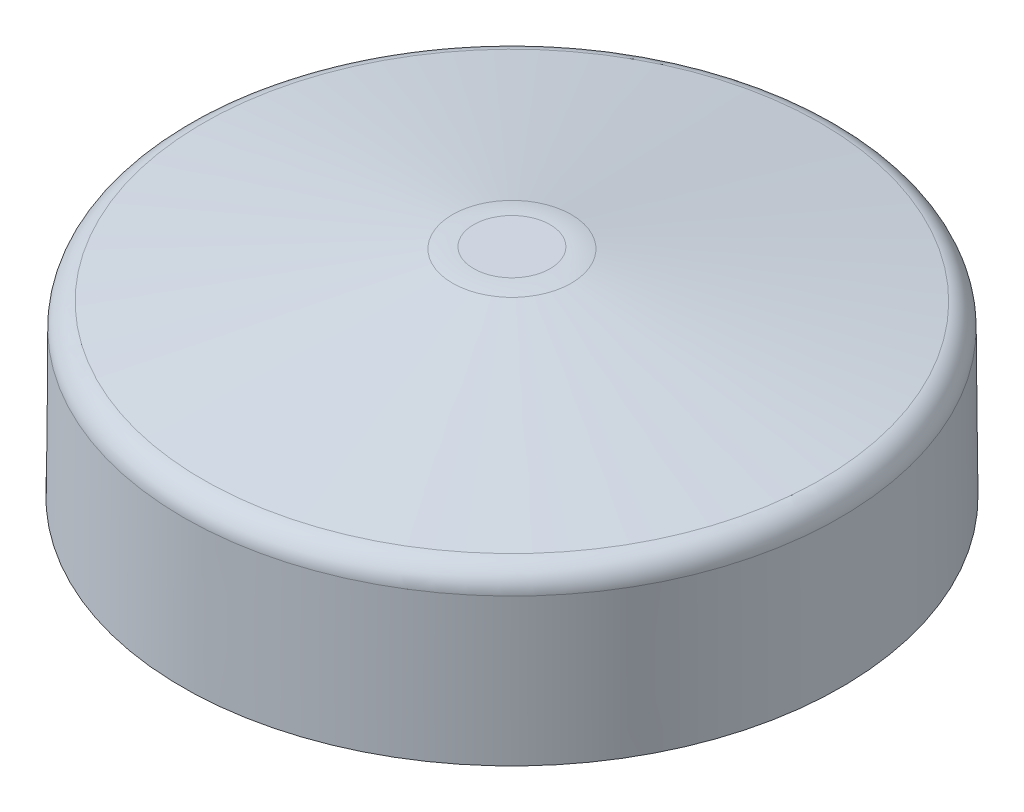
ISO-10303-21;
HEADER;
FILE_DESCRIPTION(('STEP AP214'),'2;1');
FILE_NAME('part.step','',(''),(''),'','','');
FILE_SCHEMA(('AUTOMOTIVE_DESIGN { 1 0 10303 214 1 1 1 1 }'));
ENDSEC;
DATA;
#1=APPLICATION_CONTEXT('core data for automotive mechanical design processes');
#2=APPLICATION_PROTOCOL_DEFINITION('international standard','automotive_design',2000,#1);
#3=PRODUCT_CONTEXT('',#1,'mechanical');
#4=PRODUCT('Part','Part','',(#3));
#5=PRODUCT_RELATED_PRODUCT_CATEGORY('part','',(#4));
#6=PRODUCT_DEFINITION_FORMATION('','',#4);
#7=PRODUCT_DEFINITION_CONTEXT('part definition',#1,'design');
#8=PRODUCT_DEFINITION('design','',#6,#7);
#9=PRODUCT_DEFINITION_SHAPE('','',#8);
#10=(LENGTH_UNIT() NAMED_UNIT(*) SI_UNIT(.MILLI.,.METRE.));
#11=(NAMED_UNIT(*) PLANE_ANGLE_UNIT() SI_UNIT($,.RADIAN.));
#12=(NAMED_UNIT(*) SI_UNIT($,.STERADIAN.) SOLID_ANGLE_UNIT());
#13=UNCERTAINTY_MEASURE_WITH_UNIT(LENGTH_MEASURE(1.E-05),#10,'distance_accuracy_value','');
#14=(GEOMETRIC_REPRESENTATION_CONTEXT(3) GLOBAL_UNCERTAINTY_ASSIGNED_CONTEXT((#13)) GLOBAL_UNIT_ASSIGNED_CONTEXT((#10,
#11,#12)) REPRESENTATION_CONTEXT('',''));
#15=CARTESIAN_POINT('',(0.,0.,0.));
#16=DIRECTION('',(0.,0.,1.));
#17=DIRECTION('',(1.,0.,0.));
#18=AXIS2_PLACEMENT_3D('',#15,#16,#17);
#19=CARTESIAN_POINT('',(25.,0.,0.));
#20=DIRECTION('',(0.,-1.,0.));
#21=DIRECTION('',(0.,0.,-1.));
#22=AXIS2_PLACEMENT_3D('',#19,#20,#21);
#23=PLANE('',#22);
#24=CARTESIAN_POINT('',(25.,0.,0.));
#25=DIRECTION('',(0.,-1.,0.));
#26=DIRECTION('',(0.,0.,-1.));
#27=AXIS2_PLACEMENT_3D('',#24,#25,#26);
#28=CIRCLE('',#27,2.25);
#29=CARTESIAN_POINT('',(24.89875,0.,-2.24772072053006));
#30=VERTEX_POINT('',#29);
#31=CARTESIAN_POINT('',(24.89875,0.,2.24772072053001));
#32=VERTEX_POINT('',#31);
#33=EDGE_CURVE('E64',#30,#32,#28,.T.);
#34=ORIENTED_EDGE('',*,*,#33,.F.);
#35=CARTESIAN_POINT('',(0.,0.,0.));
#36=DIRECTION('',(0.,-1.,0.));
#37=DIRECTION('',(0.,0.,-1.));
#38=AXIS2_PLACEMENT_3D('',#35,#36,#37);
#39=CIRCLE('',#38,25.);
#40=EDGE_CURVE('E75',#32,#30,#39,.T.);
#41=ORIENTED_EDGE('',*,*,#40,.F.);
#42=EDGE_LOOP('',(#34,#41));
#43=FACE_BOUND('',#42,.T.);
#44=CARTESIAN_POINT('',(0.,0.,0.));
#45=DIRECTION('',(0.,-1.,0.));
#46=DIRECTION('',(0.,0.,-1.));
#47=AXIS2_PLACEMENT_3D('',#44,#45,#46);
#48=CIRCLE('',#47,27.8301077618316);
#49=CARTESIAN_POINT('',(0.,0.,-27.8301077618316));
#50=VERTEX_POINT('',#49);
#51=EDGE_CURVE('E71',#50,#50,#48,.T.);
#52=ORIENTED_EDGE('',*,*,#51,.T.);
#53=EDGE_LOOP('',(#52));
#54=FACE_BOUND('',#53,.T.);
#55=ADVANCED_FACE('F30',(#43,#54),#23,.T.);
#56=CARTESIAN_POINT('',(0.,11.6356765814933,0.));
#57=DIRECTION('',(0.,-1.,0.));
#58=DIRECTION('',(0.,0.,-1.));
#59=AXIS2_PLACEMENT_3D('',#56,#57,#58);
#60=CONICAL_SURFACE('',#59,24.8984569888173,0.00872664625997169);
#61=CARTESIAN_POINT('',(24.7481466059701,18.1155849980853,-2.1562970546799));
#62=CARTESIAN_POINT('',(24.7731846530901,15.0963250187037,-2.1724672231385));
#63=CARTESIAN_POINT('',(24.7982539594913,12.0770629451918,-2.18817094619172));
#64=CARTESIAN_POINT('',(24.8484550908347,6.03853461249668,-2.21864550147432));
#65=CARTESIAN_POINT('',(24.8735869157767,3.01926835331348,-2.23341633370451));
#66=CARTESIAN_POINT('',(24.89875,0.,-2.24772072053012));
#67=B_SPLINE_CURVE_WITH_KNOTS('',3,(#61,#62,#63,#64,#65,#66),.UNSPECIFIED.,.F.,.F.,(4,2,4),(0.,
9.05822095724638,18.1164419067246),.UNSPECIFIED.);
#68=CARTESIAN_POINT('',(24.8712415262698,3.30218165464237,-2.23188043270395));
#69=VERTEX_POINT('',#68);
#70=EDGE_CURVE('E67',#69,#30,#67,.T.);
#71=ORIENTED_EDGE('',*,*,#70,.F.);
#72=CARTESIAN_POINT('',(24.8712415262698,3.30218165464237,-2.23188043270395));
#73=CARTESIAN_POINT('',(24.8710039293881,3.33029760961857,-2.23176781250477));
#74=CARTESIAN_POINT('',(24.8709853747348,3.35839653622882,-2.22924584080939));
#75=CARTESIAN_POINT('',(24.8713671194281,3.41375829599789,-2.21956200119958));
#76=CARTESIAN_POINT('',(24.8717670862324,3.44102177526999,-2.21240381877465));
#77=CARTESIAN_POINT('',(24.8729666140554,3.49397039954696,-2.19362113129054));
#78=CARTESIAN_POINT('',(24.8737663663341,3.51965478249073,-2.18199448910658));
#79=CARTESIAN_POINT('',(24.8757234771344,3.56869896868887,-2.15461412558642));
#80=CARTESIAN_POINT('',(24.8768807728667,3.59205917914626,-2.1388611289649));
#81=CARTESIAN_POINT('',(24.8794983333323,3.63580059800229,-2.10366868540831));
#82=CARTESIAN_POINT('',(24.8809586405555,3.65618138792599,-2.08422872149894));
#83=CARTESIAN_POINT('',(24.8841169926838,3.69338648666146,-2.04220924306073));
#84=CARTESIAN_POINT('',(24.8858150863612,3.71021006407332,-2.01962908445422));
#85=CARTESIAN_POINT('',(24.8893783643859,3.73982643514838,-1.97196152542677));
#86=CARTESIAN_POINT('',(24.8912436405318,3.75261699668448,-1.94687274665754));
#87=CARTESIAN_POINT('',(24.895067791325,3.77378688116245,-1.89491264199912));
#88=CARTESIAN_POINT('',(24.8970266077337,3.78216891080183,-1.86804242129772));
#89=CARTESIAN_POINT('',(24.9002682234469,3.79214214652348,-1.82301287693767));
#90=CARTESIAN_POINT('',(24.9015445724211,3.7950872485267,-1.80514136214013));
#91=CARTESIAN_POINT('',(24.9040889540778,3.799015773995,-1.76921001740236));
#92=CARTESIAN_POINT('',(24.9053569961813,3.80000205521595,-1.75115050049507));
#93=CARTESIAN_POINT('',(24.9066140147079,3.8,-1.73308198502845));
#94=B_SPLINE_CURVE_WITH_KNOTS('',3,(#72,#73,#74,#75,#76,#77,#78,#79,#80,#81,#82,#83,#84,#85,#86,
#87,#88,#89,#90,#91,#92,#93),.UNSPECIFIED.,.F.,.F.,(4,2,2,2,2,2,2,2,2,2,4),(0.,
0.0842393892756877,0.168411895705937,0.252624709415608,0.336822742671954,0.421032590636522,
0.505259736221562,0.589533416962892,0.673755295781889,0.728128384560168,0.782422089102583),.UNSPECIFIED.);
#95=CARTESIAN_POINT('',(24.9066140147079,3.8,-1.73308198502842));
#96=VERTEX_POINT('',#95);
#97=EDGE_CURVE('E187',#69,#96,#94,.T.);
#98=ORIENTED_EDGE('',*,*,#97,.T.);
#99=CARTESIAN_POINT('',(0.,3.8,0.));
#100=DIRECTION('',(0.,1.,0.));
#101=DIRECTION('',(0.,0.,1.));
#102=AXIS2_PLACEMENT_3D('',#99,#100,#101);
#103=CIRCLE('',#102,24.9668379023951);
#104=CARTESIAN_POINT('',(24.9066140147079,3.8,1.73308198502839));
#105=VERTEX_POINT('',#104);
#106=EDGE_CURVE('E76',#105,#96,#103,.T.);
#107=ORIENTED_EDGE('',*,*,#106,.F.);
#108=CARTESIAN_POINT('',(24.9066140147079,3.8,1.73308198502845));
#109=CARTESIAN_POINT('',(24.9046625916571,3.8000238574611,1.76114985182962));
#110=CARTESIAN_POINT('',(24.9026816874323,3.79762716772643,1.78920847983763));
#111=CARTESIAN_POINT('',(24.8987286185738,3.78816903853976,1.84450724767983));
#112=CARTESIAN_POINT('',(24.8967564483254,3.78111124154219,1.87174800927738));
#113=CARTESIAN_POINT('',(24.8928843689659,3.76250227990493,1.92466995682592));
#114=CARTESIAN_POINT('',(24.8909844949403,3.75094896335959,1.95035038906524));
#115=CARTESIAN_POINT('',(24.8873306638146,3.72368674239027,1.99940646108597));
#116=CARTESIAN_POINT('',(24.8855766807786,3.70797857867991,2.02278251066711));
#117=CARTESIAN_POINT('',(24.8822862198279,3.6728498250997,2.06657193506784));
#118=CARTESIAN_POINT('',(24.8807497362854,3.65342933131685,2.08698538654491));
#119=CARTESIAN_POINT('',(24.8779616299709,3.61142180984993,2.12427607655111));
#120=CARTESIAN_POINT('',(24.8767100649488,3.58883414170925,2.14115259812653));
#121=CARTESIAN_POINT('',(24.8745509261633,3.54114079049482,2.17088480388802));
#122=CARTESIAN_POINT('',(24.8736433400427,3.51603519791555,2.18374063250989));
#123=CARTESIAN_POINT('',(24.8722179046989,3.46402180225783,2.20506285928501));
#124=CARTESIAN_POINT('',(24.8716998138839,3.43711512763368,2.21353197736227));
#125=CARTESIAN_POINT('',(24.8711911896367,3.39205809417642,2.22365432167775));
#126=CARTESIAN_POINT('',(24.8710784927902,3.37420143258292,2.22666073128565));
#127=CARTESIAN_POINT('',(24.8710283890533,3.33829425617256,2.23072956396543));
#128=CARTESIAN_POINT('',(24.8710907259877,3.32024406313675,2.23179482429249));
#129=CARTESIAN_POINT('',(24.8712415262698,3.30218165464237,2.23188043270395));
#130=B_SPLINE_CURVE_WITH_KNOTS('',3,(#108,#109,#110,#111,#112,#113,#114,#115,#116,#117,#118,
#119,#120,#121,#122,#123,#124,#125,#126,#127,#128,#129),.UNSPECIFIED.,.F.,.F.,(4,2,2,2,2,2,2,2,
2,2,4),(0.,0.0842946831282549,0.168523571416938,0.252792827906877,0.337047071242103,
0.421299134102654,0.505568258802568,0.589834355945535,0.674048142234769,0.728274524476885,
0.782421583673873),.UNSPECIFIED.);
#131=CARTESIAN_POINT('',(24.8712415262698,3.30218165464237,2.23188043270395));
#132=VERTEX_POINT('',#131);
#133=EDGE_CURVE('E45',#105,#132,#130,.T.);
#134=ORIENTED_EDGE('',*,*,#133,.T.);
#135=CARTESIAN_POINT('',(24.89875,0.,2.24772072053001));
#136=CARTESIAN_POINT('',(24.8934716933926,0.633333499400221,2.24471683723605));
#137=CARTESIAN_POINT('',(24.8881947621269,1.26666691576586,2.24169328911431));
#138=CARTESIAN_POINT('',(24.8776436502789,2.53333358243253,2.23560686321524));
#139=CARTESIAN_POINT('',(24.8723694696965,3.16666683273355,2.2325439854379));
#140=CARTESIAN_POINT('',(24.8670966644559,3.8,2.22946144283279));
#141=B_SPLINE_CURVE_WITH_KNOTS('',3,(#135,#136,#137,#138,#139,#140),.UNSPECIFIED.,.F.,.F.,(4,2,
4),(0.,1.90008784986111,3.80017569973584),.UNSPECIFIED.);
#142=EDGE_CURVE('E66',#32,#132,#141,.T.);
#143=ORIENTED_EDGE('',*,*,#142,.F.);
#144=ORIENTED_EDGE('',*,*,#40,.T.);
#145=EDGE_LOOP('',(#71,#98,#107,#134,#143,#144));
#146=FACE_BOUND('',#145,.T.);
#147=CARTESIAN_POINT('',(0.,10.8089531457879,0.));
#148=DIRECTION('',(0.,-1.,0.));
#149=DIRECTION('',(0.,0.,-1.));
#150=AXIS2_PLACEMENT_3D('',#147,#148,#149);
#151=CIRCLE('',#150,24.9056716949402);
#152=CARTESIAN_POINT('',(0.,10.8089531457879,-24.9056716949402));
#153=VERTEX_POINT('',#152);
#154=EDGE_CURVE('E101',#153,#153,#151,.F.);
#155=ORIENTED_EDGE('',*,*,#154,.T.);
#156=EDGE_LOOP('',(#155));
#157=FACE_BOUND('',#156,.T.);
#158=ADVANCED_FACE('F73',(#146,#157),#60,.F.);
#159=CARTESIAN_POINT('',(0.,15.4233261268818,0.));
#160=DIRECTION('',(0.,-1.,0.));
#161=DIRECTION('',(0.,0.,-1.));
#162=AXIS2_PLACEMENT_3D('',#159,#160,#161);
#163=CONICAL_SURFACE('',#162,4.12887400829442,1.39041334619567);
#164=CARTESIAN_POINT('',(0.,15.2138790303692,0.));
#165=DIRECTION('',(0.,-1.,0.));
#166=DIRECTION('',(0.,0.,-1.));
#167=AXIS2_PLACEMENT_3D('',#164,#165,#166);
#168=CIRCLE('',#167,5.27737753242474);
#169=CARTESIAN_POINT('',(0.,15.2138790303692,-5.27737753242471));
#170=VERTEX_POINT('',#169);
#171=EDGE_CURVE('E98',#170,#170,#168,.F.);
#172=CARTESIAN_POINT('',(0.,11.7840016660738,0.));
#173=DIRECTION('',(0.,-1.,0.));
#174=DIRECTION('',(0.,0.,-1.));
#175=AXIS2_PLACEMENT_3D('',#172,#173,#174);
#176=CIRCLE('',#175,24.0851161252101);
#177=CARTESIAN_POINT('',(0.,11.7840016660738,-24.0851161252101));
#178=VERTEX_POINT('',#177);
#179=EDGE_CURVE('E95',#178,#178,#176,.T.);
#180=CARTESIAN_POINT('',(0.,15.2138790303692,-5.27737753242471));
#181=CARTESIAN_POINT('',(0.,15.1781511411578,-5.47329147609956));
#182=CARTESIAN_POINT('',(0.,15.1424232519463,-5.66920541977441));
#183=CARTESIAN_POINT('',(0.,15.0709674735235,-6.0610333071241));
#184=CARTESIAN_POINT('',(0.,15.0352395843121,-6.25694725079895));
#185=CARTESIAN_POINT('',(0.,14.9637838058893,-6.64877513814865));
#186=CARTESIAN_POINT('',(0.,14.9280559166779,-6.84468908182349));
#187=CARTESIAN_POINT('',(0.,14.8566001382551,-7.23651696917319));
#188=CARTESIAN_POINT('',(0.,14.8208722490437,-7.43243091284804));
#189=CARTESIAN_POINT('',(0.,14.7494164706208,-7.82425880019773));
#190=CARTESIAN_POINT('',(0.,14.7136885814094,-8.02017274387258));
#191=CARTESIAN_POINT('',(0.,14.6422328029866,-8.41200063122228));
#192=CARTESIAN_POINT('',(0.,14.6065049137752,-8.60791457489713));
#193=CARTESIAN_POINT('',(0.,14.5350491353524,-8.99974246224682));
#194=CARTESIAN_POINT('',(0.,14.499321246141,-9.19565640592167));
#195=CARTESIAN_POINT('',(0.,14.4278654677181,-9.58748429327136));
#196=CARTESIAN_POINT('',(0.,14.3921375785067,-9.78339823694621));
#197=CARTESIAN_POINT('',(0.,14.3206818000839,-10.1752261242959));
#198=CARTESIAN_POINT('',(0.,14.2849539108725,-10.3711400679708));
#199=CARTESIAN_POINT('',(0.,14.2134981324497,-10.7629679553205));
#200=CARTESIAN_POINT('',(0.,14.1777702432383,-10.9588818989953));
#201=CARTESIAN_POINT('',(0.,14.1063144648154,-11.350709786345));
#202=CARTESIAN_POINT('',(0.,14.070586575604,-11.5466237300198));
#203=CARTESIAN_POINT('',(0.,13.9991307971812,-11.9384516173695));
#204=CARTESIAN_POINT('',(0.,13.9634029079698,-12.1343655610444));
#205=CARTESIAN_POINT('',(0.,13.891947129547,-12.5261934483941));
#206=CARTESIAN_POINT('',(0.,13.8562192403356,-12.7221073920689));
#207=CARTESIAN_POINT('',(0.,13.7847634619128,-13.1139352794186));
#208=CARTESIAN_POINT('',(0.,13.7490355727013,-13.3098492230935));
#209=CARTESIAN_POINT('',(0.,13.6775797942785,-13.7016771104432));
#210=CARTESIAN_POINT('',(0.,13.6418519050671,-13.897591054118));
#211=CARTESIAN_POINT('',(0.,13.5703961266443,-14.2894189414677));
#212=CARTESIAN_POINT('',(0.,13.5346682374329,-14.4853328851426));
#213=CARTESIAN_POINT('',(0.,13.4632124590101,-14.8771607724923));
#214=CARTESIAN_POINT('',(0.,13.4274845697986,-15.0730747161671));
#215=CARTESIAN_POINT('',(0.,13.3560287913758,-15.4649026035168));
#216=CARTESIAN_POINT('',(0.,13.3203009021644,-15.6608165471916));
#217=CARTESIAN_POINT('',(0.,13.2488451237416,-16.0526444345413));
#218=CARTESIAN_POINT('',(0.,13.2131172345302,-16.2485583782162));
#219=CARTESIAN_POINT('',(0.,13.1416614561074,-16.6403862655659));
#220=CARTESIAN_POINT('',(0.,13.105933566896,-16.8363002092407));
#221=CARTESIAN_POINT('',(0.,13.0344777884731,-17.2281280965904));
#222=CARTESIAN_POINT('',(0.,12.9987498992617,-17.4240420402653));
#223=CARTESIAN_POINT('',(0.,12.9272941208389,-17.815869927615));
#224=CARTESIAN_POINT('',(0.,12.8915662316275,-18.0117838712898));
#225=CARTESIAN_POINT('',(0.,12.8201104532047,-18.4036117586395));
#226=CARTESIAN_POINT('',(0.,12.7843825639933,-18.5995257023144));
#227=CARTESIAN_POINT('',(0.,12.7129267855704,-18.9913535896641));
#228=CARTESIAN_POINT('',(0.,12.677198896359,-19.1872675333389));
#229=CARTESIAN_POINT('',(0.,12.6057431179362,-19.5790954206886));
#230=CARTESIAN_POINT('',(0.,12.5700152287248,-19.7750093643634));
#231=CARTESIAN_POINT('',(0.,12.498559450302,-20.1668372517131));
#232=CARTESIAN_POINT('',(0.,12.4628315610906,-20.362751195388));
#233=CARTESIAN_POINT('',(0.,12.3913757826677,-20.7545790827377));
#234=CARTESIAN_POINT('',(0.,12.3556478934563,-20.9504930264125));
#235=CARTESIAN_POINT('',(0.,12.2841921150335,-21.3423209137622));
#236=CARTESIAN_POINT('',(0.,12.2484642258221,-21.5382348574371));
#237=CARTESIAN_POINT('',(0.,12.1770084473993,-21.9300627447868));
#238=CARTESIAN_POINT('',(0.,12.1412805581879,-22.1259766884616));
#239=CARTESIAN_POINT('',(0.,12.0698247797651,-22.5178045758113));
#240=CARTESIAN_POINT('',(0.,12.0340968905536,-22.7137185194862));
#241=CARTESIAN_POINT('',(0.,11.9626411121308,-23.1055464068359));
#242=CARTESIAN_POINT('',(0.,11.9269132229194,-23.3014603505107));
#243=CARTESIAN_POINT('',(0.,11.8554574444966,-23.6932882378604));
#244=CARTESIAN_POINT('',(0.,11.8197295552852,-23.8892021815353));
#245=CARTESIAN_POINT('',(0.,11.7840016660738,-24.0851161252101));
#246=B_SPLINE_CURVE_WITH_KNOTS('',3,(#180,#181,#182,#183,#184,#185,#186,#187,#188,#189,#190,
#191,#192,#193,#194,#195,#196,#197,#198,#199,#200,#201,#202,#203,#204,#205,#206,#207,#208,#209,
#210,#211,#212,#213,#214,#215,#216,#217,#218,#219,#220,#221,#222,#223,#224,#225,#226,#227,#228,
#229,#230,#231,#232,#233,#234,#235,#236,#237,#238,#239,#240,#241,#242,#243,#244,#245),
.UNSPECIFIED.,.F.,.F.,(4,2,2,2,2,2,2,2,2,2,2,2,2,2,2,2,2,2,2,2,2,2,2,2,2,2,2,2,2,2,2,2,4),(0.,
0.597435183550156,1.19487036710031,1.79230555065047,2.38974073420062,2.98717591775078,
3.58461110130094,4.18204628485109,4.77948146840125,5.3769166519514,5.97435183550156,
6.57178701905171,7.16922220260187,7.76665738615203,8.36409256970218,8.96152775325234,
9.55896293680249,10.1563981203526,10.7538333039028,11.351268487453,11.9487036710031,
12.5461388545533,13.1435740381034,13.7410092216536,14.3384444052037,14.9358795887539,
15.5333147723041,16.1307499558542,16.7281851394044,17.3256203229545,17.9230555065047,
18.5204906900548,19.117925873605),.UNSPECIFIED.);
#247=EDGE_CURVE('BSEAM127',#170,#178,#246,.T.);
#248=ORIENTED_EDGE('',*,*,#171,.T.);
#249=ORIENTED_EDGE('',*,*,#179,.T.);
#250=ORIENTED_EDGE('',*,*,#247,.T.);
#251=ORIENTED_EDGE('',*,*,#247,.F.);
#252=EDGE_LOOP('',(#248,#250,#249,#251));
#253=FACE_BOUND('',#252,.T.);
#254=ADVANCED_FACE('F127',(#253),#163,.F.);
#255=CARTESIAN_POINT('',(0.,0.,0.));
#256=DIRECTION('',(0.,1.,0.));
#257=DIRECTION('',(0.,0.,1.));
#258=AXIS2_PLACEMENT_3D('',#255,#256,#257);
#259=CONICAL_SURFACE('',#258,3.725,0.0261799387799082);
#260=CARTESIAN_POINT('',(0.,14.2562809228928,0.));
#261=DIRECTION('',(0.,1.,0.));
#262=DIRECTION('',(0.,0.,1.));
#263=AXIS2_PLACEMENT_3D('',#260,#261,#262);
#264=CIRCLE('',#263,4.09831385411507);
#265=CARTESIAN_POINT('',(0.,14.2562809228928,4.09831385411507));
#266=VERTEX_POINT('',#265);
#267=EDGE_CURVE('E92',#266,#266,#264,.F.);
#268=ORIENTED_EDGE('',*,*,#267,.T.);
#269=EDGE_LOOP('',(#268));
#270=FACE_BOUND('',#269,.T.);
#271=CARTESIAN_POINT('',(0.,0.,0.));
#272=DIRECTION('',(0.,-1.,0.));
#273=DIRECTION('',(0.,0.,-1.));
#274=AXIS2_PLACEMENT_3D('',#271,#272,#273);
#275=CIRCLE('',#274,3.725);
#276=CARTESIAN_POINT('',(0.,0.,-3.725));
#277=VERTEX_POINT('',#276);
#278=EDGE_CURVE('E80',#277,#277,#275,.T.);
#279=ORIENTED_EDGE('',*,*,#278,.F.);
#280=EDGE_LOOP('',(#279));
#281=FACE_BOUND('',#280,.T.);
#282=ADVANCED_FACE('F131',(#270,#281),#259,.T.);
#283=CARTESIAN_POINT('',(3.725,0.,0.));
#284=DIRECTION('',(0.,-1.,0.));
#285=DIRECTION('',(0.,0.,-1.));
#286=AXIS2_PLACEMENT_3D('',#283,#284,#285);
#287=PLANE('',#286);
#288=ORIENTED_EDGE('',*,*,#278,.T.);
#289=EDGE_LOOP('',(#288));
#290=FACE_BOUND('',#289,.T.);
#291=CARTESIAN_POINT('',(0.,0.,0.));
#292=DIRECTION('',(0.,-1.,0.));
#293=DIRECTION('',(0.,0.,-1.));
#294=AXIS2_PLACEMENT_3D('',#291,#292,#293);
#295=CIRCLE('',#294,1.725);
#296=CARTESIAN_POINT('',(0.,0.,-1.725));
#297=VERTEX_POINT('',#296);
#298=EDGE_CURVE('E86',#297,#297,#295,.T.);
#299=ORIENTED_EDGE('',*,*,#298,.F.);
#300=EDGE_LOOP('',(#299));
#301=FACE_BOUND('',#300,.T.);
#302=ADVANCED_FACE('F136',(#290,#301),#287,.T.);
#303=CARTESIAN_POINT('',(0.,0.,0.));
#304=DIRECTION('',(0.,-1.,0.));
#305=DIRECTION('',(0.,0.,-1.));
#306=AXIS2_PLACEMENT_3D('',#303,#304,#305);
#307=CONICAL_SURFACE('',#306,1.725,0.00436332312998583);
#308=ORIENTED_EDGE('',*,*,#298,.T.);
#309=EDGE_LOOP('',(#308));
#310=FACE_BOUND('',#309,.T.);
#311=CARTESIAN_POINT('',(0.,15.3,0.));
#312=DIRECTION('',(0.,-1.,0.));
#313=DIRECTION('',(0.,0.,-1.));
#314=AXIS2_PLACEMENT_3D('',#311,#312,#313);
#315=CIRCLE('',#314,1.65824073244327);
#316=CARTESIAN_POINT('',(0.,15.3,-1.65824073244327));
#317=VERTEX_POINT('',#316);
#318=EDGE_CURVE('E192',#317,#317,#315,.T.);
#319=ORIENTED_EDGE('',*,*,#318,.F.);
#320=EDGE_LOOP('',(#319));
#321=FACE_BOUND('',#320,.T.);
#322=ADVANCED_FACE('F32',(#310,#321),#307,.F.);
#323=CARTESIAN_POINT('',(1.725,15.3,0.));
#324=DIRECTION('',(0.,-1.,0.));
#325=DIRECTION('',(0.,0.,-1.));
#326=AXIS2_PLACEMENT_3D('',#323,#324,#325);
#327=PLANE('',#326);
#328=ORIENTED_EDGE('',*,*,#318,.T.);
#329=EDGE_LOOP('',(#328));
#330=FACE_BOUND('',#329,.T.);
#331=ADVANCED_FACE('F144',(#330),#327,.T.);
#332=CARTESIAN_POINT('',(4.12887400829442,18.3,0.));
#333=DIRECTION('',(0.,1.,0.));
#334=DIRECTION('',(0.,0.,1.));
#335=AXIS2_PLACEMENT_3D('',#332,#333,#334);
#336=PLANE('',#335);
#337=CARTESIAN_POINT('',(0.,18.3,0.));
#338=DIRECTION('',(0.,1.,0.));
#339=DIRECTION('',(0.,0.,1.));
#340=AXIS2_PLACEMENT_3D('',#337,#338,#339);
#341=CIRCLE('',#340,3.22450557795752);
#342=CARTESIAN_POINT('',(0.,18.3,3.22450557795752));
#343=VERTEX_POINT('',#342);
#344=EDGE_CURVE('E11',#343,#343,#341,.T.);
#345=ORIENTED_EDGE('',*,*,#344,.T.);
#346=EDGE_LOOP('',(#345));
#347=FACE_BOUND('',#346,.T.);
#348=ADVANCED_FACE('F147',(#347),#336,.T.);
#349=CARTESIAN_POINT('',(0.,14.,0.));
#350=DIRECTION('',(0.,-1.,0.));
#351=DIRECTION('',(0.,0.,-1.));
#352=AXIS2_PLACEMENT_3D('',#349,#350,#351);
#353=CONICAL_SURFACE('',#352,27.707931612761,1.39041334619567);
#354=CARTESIAN_POINT('',(0.,18.1377505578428,0.));
#355=DIRECTION('',(0.,1.,0.));
#356=DIRECTION('',(0.,0.,1.));
#357=AXIS2_PLACEMENT_3D('',#354,#355,#356);
#358=CIRCLE('',#357,5.01856911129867);
#359=CARTESIAN_POINT('',(0.,18.1377505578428,-5.01856911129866));
#360=VERTEX_POINT('',#359);
#361=EDGE_CURVE('E38',#360,#360,#358,.F.);
#362=CARTESIAN_POINT('',(0.,14.296650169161,0.));
#363=DIRECTION('',(0.,1.,0.));
#364=DIRECTION('',(0.,0.,1.));
#365=AXIS2_PLACEMENT_3D('',#362,#363,#364);
#366=CIRCLE('',#365,26.0812498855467);
#367=CARTESIAN_POINT('',(0.,14.296650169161,-26.0812498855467));
#368=VERTEX_POINT('',#367);
#369=EDGE_CURVE('E83',#368,#368,#366,.T.);
#370=CARTESIAN_POINT('',(0.,18.1377505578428,-5.01856911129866));
#371=CARTESIAN_POINT('',(0.,18.0977390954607,-5.23797203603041));
#372=CARTESIAN_POINT('',(0.,18.0577276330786,-5.45737496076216));
#373=CARTESIAN_POINT('',(0.,17.9777047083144,-5.89618081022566));
#374=CARTESIAN_POINT('',(0.,17.9376932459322,-6.11558373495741));
#375=CARTESIAN_POINT('',(0.,17.857670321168,-6.55438958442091));
#376=CARTESIAN_POINT('',(0.,17.8176588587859,-6.77379250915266));
#377=CARTESIAN_POINT('',(0.,17.7376359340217,-7.21259835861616));
#378=CARTESIAN_POINT('',(0.,17.6976244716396,-7.43200128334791));
#379=CARTESIAN_POINT('',(0.,17.6176015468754,-7.87080713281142));
#380=CARTESIAN_POINT('',(0.,17.5775900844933,-8.09021005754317));
#381=CARTESIAN_POINT('',(0.,17.4975671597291,-8.52901590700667));
#382=CARTESIAN_POINT('',(0.,17.457555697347,-8.74841883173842));
#383=CARTESIAN_POINT('',(0.,17.3775327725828,-9.18722468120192));
#384=CARTESIAN_POINT('',(0.,17.3375213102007,-9.40662760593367));
#385=CARTESIAN_POINT('',(0.,17.2574983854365,-9.84543345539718));
#386=CARTESIAN_POINT('',(0.,17.2174869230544,-10.0648363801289));
#387=CARTESIAN_POINT('',(0.,17.1374639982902,-10.5036422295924));
#388=CARTESIAN_POINT('',(0.,17.0974525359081,-10.7230451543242));
#389=CARTESIAN_POINT('',(0.,17.0174296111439,-11.1618510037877));
#390=CARTESIAN_POINT('',(0.,16.9774181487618,-11.3812539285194));
#391=CARTESIAN_POINT('',(0.,16.8973952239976,-11.8200597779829));
#392=CARTESIAN_POINT('',(0.,16.8573837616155,-12.0394627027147));
#393=CARTESIAN_POINT('',(0.,16.7773608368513,-12.4782685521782));
#394=CARTESIAN_POINT('',(0.,16.7373493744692,-12.6976714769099));
#395=CARTESIAN_POINT('',(0.,16.657326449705,-13.1364773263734));
#396=CARTESIAN_POINT('',(0.,16.6173149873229,-13.3558802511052));
#397=CARTESIAN_POINT('',(0.,16.5372920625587,-13.7946861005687));
#398=CARTESIAN_POINT('',(0.,16.4972806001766,-14.0140890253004));
#399=CARTESIAN_POINT('',(0.,16.4172576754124,-14.4528948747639));
#400=CARTESIAN_POINT('',(0.,16.3772462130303,-14.6722977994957));
#401=CARTESIAN_POINT('',(0.,16.2972232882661,-15.1111036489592));
#402=CARTESIAN_POINT('',(0.,16.257211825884,-15.330506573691));
#403=CARTESIAN_POINT('',(0.,16.1771889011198,-15.7693124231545));
#404=CARTESIAN_POINT('',(0.,16.1371774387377,-15.9887153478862));
#405=CARTESIAN_POINT('',(0.,16.0571545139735,-16.4275211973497));
#406=CARTESIAN_POINT('',(0.,16.0171430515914,-16.6469241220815));
#407=CARTESIAN_POINT('',(0.,15.9371201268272,-17.085729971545));
#408=CARTESIAN_POINT('',(0.,15.897108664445,-17.3051328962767));
#409=CARTESIAN_POINT('',(0.,15.8170857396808,-17.7439387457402));
#410=CARTESIAN_POINT('',(0.,15.7770742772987,-17.963341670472));
#411=CARTESIAN_POINT('',(0.,15.6970513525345,-18.4021475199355));
#412=CARTESIAN_POINT('',(0.,15.6570398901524,-18.6215504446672));
#413=CARTESIAN_POINT('',(0.,15.5770169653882,-19.0603562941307));
#414=CARTESIAN_POINT('',(0.,15.5370055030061,-19.2797592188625));
#415=CARTESIAN_POINT('',(0.,15.4569825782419,-19.718565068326));
#416=CARTESIAN_POINT('',(0.,15.4169711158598,-19.9379679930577));
#417=CARTESIAN_POINT('',(0.,15.3369481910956,-20.3767738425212));
#418=CARTESIAN_POINT('',(0.,15.2969367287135,-20.596176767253));
#419=CARTESIAN_POINT('',(0.,15.2169138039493,-21.0349826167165));
#420=CARTESIAN_POINT('',(0.,15.1769023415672,-21.2543855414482));
#421=CARTESIAN_POINT('',(0.,15.096879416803,-21.6931913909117));
#422=CARTESIAN_POINT('',(0.,15.0568679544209,-21.9125943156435));
#423=CARTESIAN_POINT('',(0.,14.9768450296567,-22.351400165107));
#424=CARTESIAN_POINT('',(0.,14.9368335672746,-22.5708030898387));
#425=CARTESIAN_POINT('',(0.,14.8568106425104,-23.0096089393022));
#426=CARTESIAN_POINT('',(0.,14.8167991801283,-23.229011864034));
#427=CARTESIAN_POINT('',(0.,14.7367762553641,-23.6678177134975));
#428=CARTESIAN_POINT('',(0.,14.696764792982,-23.8872206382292));
#429=CARTESIAN_POINT('',(0.,14.6167418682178,-24.3260264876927));
#430=CARTESIAN_POINT('',(0.,14.5767304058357,-24.5454294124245));
#431=CARTESIAN_POINT('',(0.,14.4967074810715,-24.984235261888));
#432=CARTESIAN_POINT('',(0.,14.4566960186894,-25.2036381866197));
#433=CARTESIAN_POINT('',(0.,14.3766730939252,-25.6424440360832));
#434=CARTESIAN_POINT('',(0.,14.3366616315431,-25.861846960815));
#435=CARTESIAN_POINT('',(0.,14.296650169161,-26.0812498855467));
#436=B_SPLINE_CURVE_WITH_KNOTS('',3,(#370,#371,#372,#373,#374,#375,#376,#377,#378,#379,#380,
#381,#382,#383,#384,#385,#386,#387,#388,#389,#390,#391,#392,#393,#394,#395,#396,#397,#398,#399,
#400,#401,#402,#403,#404,#405,#406,#407,#408,#409,#410,#411,#412,#413,#414,#415,#416,#417,#418,
#419,#420,#421,#422,#423,#424,#425,#426,#427,#428,#429,#430,#431,#432,#433,#434,#435),
.UNSPECIFIED.,.F.,.F.,(4,2,2,2,2,2,2,2,2,2,2,2,2,2,2,2,2,2,2,2,2,2,2,2,2,2,2,2,2,2,2,2,4),(0.,
0.669064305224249,1.3381286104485,2.00719291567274,2.67625722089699,3.34532152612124,
4.01438583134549,4.68345013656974,5.35251444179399,6.02157874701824,6.69064305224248,
7.35970735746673,8.02877166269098,8.69783596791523,9.36690027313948,10.0359645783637,
10.705028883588,11.3740931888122,12.0431574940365,12.7122217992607,13.381286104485,
14.0503504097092,14.7194147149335,15.3884790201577,16.057543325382,16.7266076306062,
17.3956719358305,18.0647362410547,18.733800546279,19.4028648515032,20.0719291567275,
20.7409934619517,21.410057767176),.UNSPECIFIED.);
#437=EDGE_CURVE('BSEAM151',#360,#368,#436,.T.);
#438=ORIENTED_EDGE('',*,*,#361,.T.);
#439=ORIENTED_EDGE('',*,*,#369,.T.);
#440=ORIENTED_EDGE('',*,*,#437,.T.);
#441=ORIENTED_EDGE('',*,*,#437,.F.);
#442=EDGE_LOOP('',(#438,#440,#439,#441));
#443=FACE_BOUND('',#442,.T.);
#444=ADVANCED_FACE('F151',(#443),#353,.T.);
#445=CARTESIAN_POINT('',(0.,0.,0.));
#446=DIRECTION('',(0.,-1.,0.));
#447=DIRECTION('',(0.,0.,-1.));
#448=AXIS2_PLACEMENT_3D('',#445,#446,#447);
#449=CONICAL_SURFACE('',#448,27.8301077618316,0.00872664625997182);
#450=CARTESIAN_POINT('',(0.,12.3465531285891,0.));
#451=DIRECTION('',(0.,1.,0.));
#452=DIRECTION('',(0.,0.,1.));
#453=AXIS2_PLACEMENT_3D('',#450,#451,#452);
#454=CIRCLE('',#453,27.7223610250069);
#455=CARTESIAN_POINT('',(0.,12.3465531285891,27.7223610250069));
#456=VERTEX_POINT('',#455);
#457=EDGE_CURVE('E79',#456,#456,#454,.F.);
#458=ORIENTED_EDGE('',*,*,#457,.T.);
#459=EDGE_LOOP('',(#458));
#460=FACE_BOUND('',#459,.T.);
#461=ORIENTED_EDGE('',*,*,#51,.F.);
#462=EDGE_LOOP('',(#461));
#463=FACE_BOUND('',#462,.T.);
#464=ADVANCED_FACE('F155',(#460,#463),#449,.T.);
#465=CARTESIAN_POINT('',(0.,12.3291000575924,0.));
#466=DIRECTION('',(0.,1.,0.));
#467=DIRECTION('',(0.,0.,1.));
#468=AXIS2_PLACEMENT_3D('',#465,#466,#467);
#469=TOROIDAL_SURFACE('',#468,25.7224371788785,2.);
#470=ORIENTED_EDGE('',*,*,#369,.F.);
#471=EDGE_LOOP('',(#470));
#472=FACE_BOUND('',#471,.T.);
#473=ORIENTED_EDGE('',*,*,#457,.F.);
#474=EDGE_LOOP('',(#473));
#475=FACE_BOUND('',#474,.T.);
#476=ADVANCED_FACE('F159',(#472,#475),#469,.T.);
#477=CARTESIAN_POINT('',(0.,14.2301039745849,0.));
#478=DIRECTION('',(0.,-1.,0.));
#479=DIRECTION('',(0.,0.,-1.));
#480=AXIS2_PLACEMENT_3D('',#477,#478,#479);
#481=TOROIDAL_SURFACE('',#480,5.09797117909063,1.);
#482=ORIENTED_EDGE('',*,*,#171,.F.);
#483=EDGE_LOOP('',(#482));
#484=FACE_BOUND('',#483,.T.);
#485=ORIENTED_EDGE('',*,*,#267,.F.);
#486=EDGE_LOOP('',(#485));
#487=FACE_BOUND('',#486,.T.);
#488=ADVANCED_FACE('F163',(#484,#487),#481,.F.);
#489=CARTESIAN_POINT('',(0.,10.8002266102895,0.));
#490=DIRECTION('',(0.,-1.,0.));
#491=DIRECTION('',(0.,0.,-1.));
#492=AXIS2_PLACEMENT_3D('',#489,#490,#491);
#493=TOROIDAL_SURFACE('',#492,23.905709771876,1.);
#494=ORIENTED_EDGE('',*,*,#154,.F.);
#495=EDGE_LOOP('',(#494));
#496=FACE_BOUND('',#495,.T.);
#497=ORIENTED_EDGE('',*,*,#179,.F.);
#498=EDGE_LOOP('',(#497));
#499=FACE_BOUND('',#498,.T.);
#500=ADVANCED_FACE('F121',(#496,#499),#493,.F.);
#501=CARTESIAN_POINT('',(25.,0.,0.));
#502=DIRECTION('',(0.,-1.,0.));
#503=DIRECTION('',(0.,0.,-1.));
#504=AXIS2_PLACEMENT_3D('',#501,#502,#503);
#505=CONICAL_SURFACE('',#504,2.25,0.00436332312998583);
#506=ORIENTED_EDGE('',*,*,#142,.T.);
#507=CARTESIAN_POINT('',(25.,3.30218165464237,0.));
#508=DIRECTION('',(0.,-1.,0.));
#509=DIRECTION('',(0.,0.,-1.));
#510=AXIS2_PLACEMENT_3D('',#507,#508,#509);
#511=CIRCLE('',#510,2.23559142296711);
#512=EDGE_CURVE('E52',#132,#69,#511,.F.);
#513=ORIENTED_EDGE('',*,*,#512,.T.);
#514=ORIENTED_EDGE('',*,*,#70,.T.);
#515=ORIENTED_EDGE('',*,*,#33,.T.);
#516=EDGE_LOOP('',(#506,#513,#514,#515));
#517=FACE_BOUND('',#516,.T.);
#518=ADVANCED_FACE('F65',(#517),#505,.F.);
#519=CARTESIAN_POINT('',(27.25,3.8,0.));
#520=DIRECTION('',(0.,1.,0.));
#521=DIRECTION('',(0.,0.,1.));
#522=AXIS2_PLACEMENT_3D('',#519,#520,#521);
#523=PLANE('',#522);
#524=ORIENTED_EDGE('',*,*,#106,.T.);
#525=CARTESIAN_POINT('',(25.,3.8,0.));
#526=DIRECTION('',(0.,1.,0.));
#527=DIRECTION('',(0.,0.,1.));
#528=AXIS2_PLACEMENT_3D('',#525,#526,#527);
#529=CIRCLE('',#528,1.73559618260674);
#530=EDGE_CURVE('E110',#96,#105,#529,.F.);
#531=ORIENTED_EDGE('',*,*,#530,.T.);
#532=EDGE_LOOP('',(#524,#531));
#533=FACE_BOUND('',#532,.T.);
#534=ADVANCED_FACE('F120',(#533),#523,.F.);
#535=CARTESIAN_POINT('',(25.,3.3,0.));
#536=DIRECTION('',(0.,1.,0.));
#537=DIRECTION('',(0.,0.,1.));
#538=AXIS2_PLACEMENT_3D('',#535,#536,#537);
#539=TOROIDAL_SURFACE('',#538,1.73559618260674,0.5);
#540=ORIENTED_EDGE('',*,*,#97,.F.);
#541=ORIENTED_EDGE('',*,*,#512,.F.);
#542=ORIENTED_EDGE('',*,*,#133,.F.);
#543=ORIENTED_EDGE('',*,*,#530,.F.);
#544=EDGE_LOOP('',(#540,#541,#542,#543));
#545=FACE_BOUND('',#544,.T.);
#546=ADVANCED_FACE('F173',(#545),#539,.F.);
#547=CARTESIAN_POINT('',(0.,8.3,0.));
#548=DIRECTION('',(0.,1.,0.));
#549=DIRECTION('',(0.,0.,1.));
#550=AXIS2_PLACEMENT_3D('',#547,#548,#549);
#551=DEGENERATE_TOROIDAL_SURFACE('',#550,3.22450557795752,10.,.T.);
#552=ORIENTED_EDGE('',*,*,#344,.F.);
#553=EDGE_LOOP('',(#552));
#554=FACE_BOUND('',#553,.T.);
#555=ORIENTED_EDGE('',*,*,#361,.F.);
#556=EDGE_LOOP('',(#555));
#557=FACE_BOUND('',#556,.T.);
#558=ADVANCED_FACE('F178',(#554,#557),#551,.T.);
#559=CLOSED_SHELL('',(#55,#158,#254,#282,#302,#322,#331,#348,#444,#464,#476,#488,#500,#518,#534,
#546,#558));
#560=MANIFOLD_SOLID_BREP('B2',#559);
#561=ADVANCED_BREP_SHAPE_REPRESENTATION('',(#18,#560),#14);
#562=SHAPE_DEFINITION_REPRESENTATION(#9,#561);
ENDSEC;
END-ISO-10303-21;
